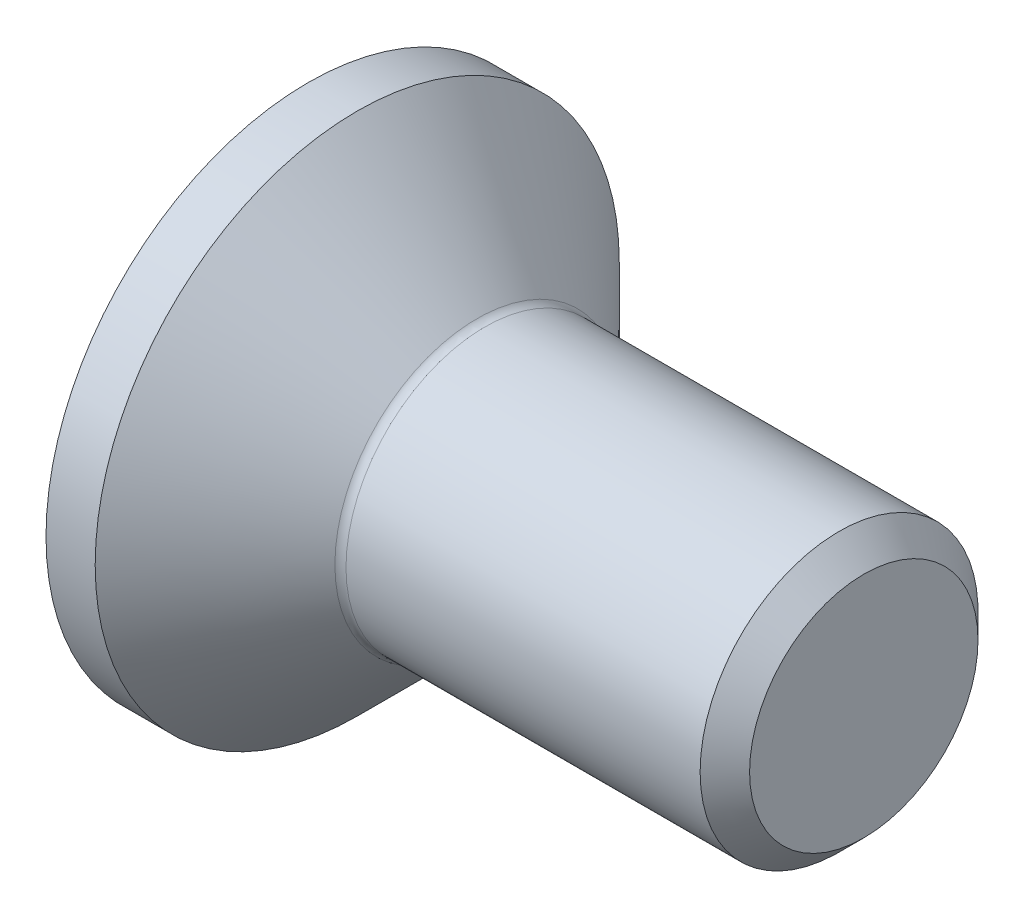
from build123d import *

# Parameters (mm, degrees)
FILLET1_R   = 0.2
HEX_2_DEPTH = 1.9


with BuildPart() as part:
    # BodySke → BaseBody (revolve)
    with BuildSketch(Plane.XY, mode=Mode.PRIVATE) as basebody_sk:
        Polygon((0, 0), (0, 4.715), (0.885, 4.715), (3.1, 2.5), (9.555, 2.5), (10, 2.055), (10, 0), align=None)
    revolve(basebody_sk.sketch.rotate(Axis((0, 0, 0), (1, 0, 0)), 90), axis=Axis((0, 0, 0), (1, 0, 0)))

    # Fillet1
    fillet1_edges = [part.edges().sort_by_distance(p)[0] for p in [
        (3.1, 0, -2.5),
    ]]
    fillet(fillet1_edges, radius=FILLET1_R)

    # Sketch2 → PreBroach (revolve, cut)
    with BuildSketch(Plane.XY, mode=Mode.PRIVATE) as prebroach_sk:
        Polygon((0, 1.5), (1.9, 1.5), (2.766025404, 0), (0, 0), align=None)
    revolve(prebroach_sk.sketch.rotate(Axis((0, 0, 0), (1, 0, 0)), 90), axis=Axis((0, 0, 0), (1, 0, 0)), mode=Mode.SUBTRACT)

    # Sketch3 → Hex 2 (cut)
    with BuildSketch(Plane.ZY):
        Polygon((-1.5, -0.866025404), (-1.5, 0.866025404), (0, 1.732050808), (1.5, 0.866025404), (1.5, -0.866025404), (0, -1.732050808), align=None)
    extrude(amount=-HEX_2_DEPTH, mode=Mode.SUBTRACT)


solid = part.part
